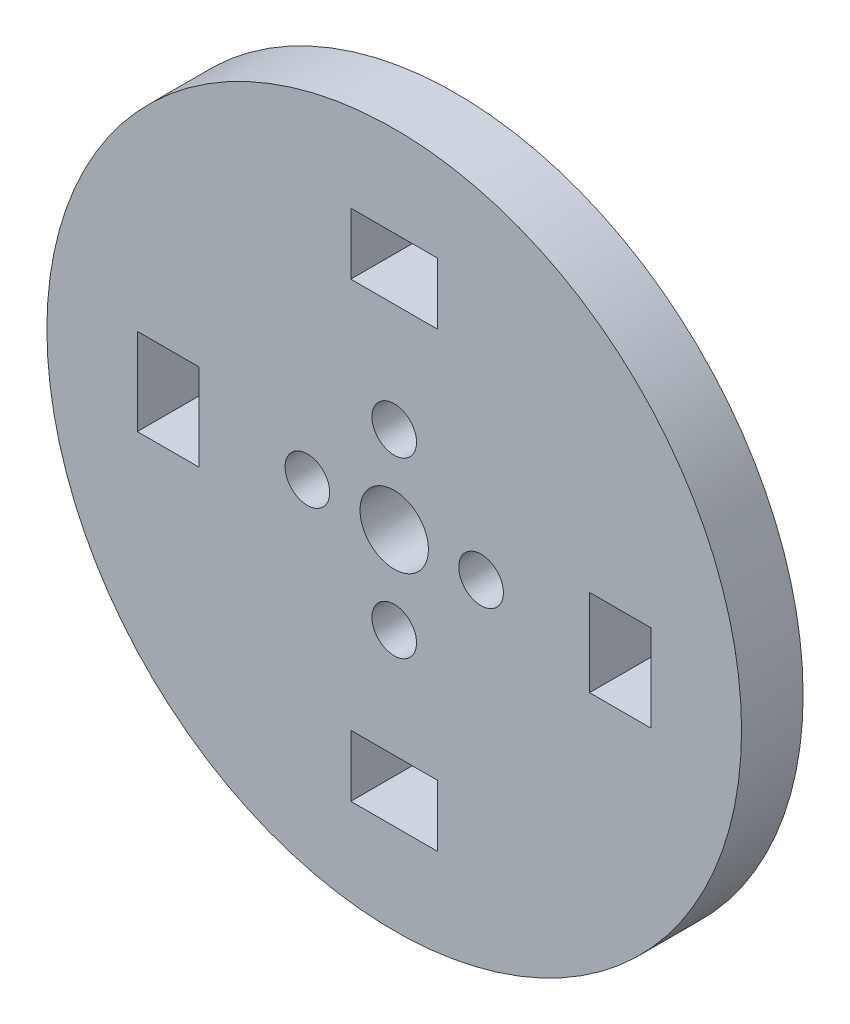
from build123d import *

# Parameters (mm, degrees)
SKETCH1_R                 = 25.4
SKETCH1_R_2               = 2.5
BOSS_EXTRUDE1_DEPTH       = 4.5
CUT_EXTRUDE1_DEPTH        = 37.201795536
F_4_CLEARANCE_HOLE1_D     = 3.2639
F_4_CLEARANCE_HOLE1_DEPTH = 25.4
F_4_CLEARANCE_HOLE1_TIP   = 0.980574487


with BuildPart() as part:
    # Sketch1 → Boss-Extrude1 (new body)
    with BuildSketch(Plane.XY):
        Circle(SKETCH1_R)
        Circle(SKETCH1_R_2, mode=Mode.SUBTRACT)
    extrude(amount=BOSS_EXTRUDE1_DEPTH)

    # Sketch2 → Cut-Extrude1 (cut, through all)
    with BuildSketch(Plane.XY.offset(4.5)):
        with BuildLine():
            Line((-14.283553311, 3.175), (-17.171437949, 3.175))
            ThreePointArc((-17.171437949, 3.175), (-17.4625, 0), (-17.171437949, -3.175))
            Line((-17.171437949, -3.175), (-14.283553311, -3.175))
            Line((-14.283553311, -3.175), (-14.283553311, 3.175))
        make_face()
        with BuildLine():
            Line((-17.171437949, 3.175), (-18.783553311, 3.175))
            Line((-18.783553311, 3.175), (-18.783553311, -3.175))
            Line((-18.783553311, -3.175), (-17.171437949, -3.175))
            ThreePointArc((-17.171437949, -3.175), (-17.4625, 0), (-17.171437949, 3.175))
        make_face()
        with BuildLine():
            Line((3.175, 18.783553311), (0, 18.783553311))
            Line((0, 18.783553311), (0, 17.4625))
            ThreePointArc((0, 17.4625), (1.594156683, 17.389582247), (3.175, 17.171437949))
            Line((3.175, 17.171437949), (3.175, 18.783553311))
        make_face()
        with BuildLine():
            Line((0, 17.4625), (0, 18.783553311))
            Line((0, 18.783553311), (-3.175, 18.783553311))
            Line((-3.175, 18.783553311), (-3.175, 17.171437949))
            ThreePointArc((-3.175, 17.171437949), (-1.594156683, 17.389582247), (0, 17.4625))
        make_face()
        with BuildLine():
            Line((0, 14.283553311), (0, 17.4625))
            ThreePointArc((0, 17.4625), (-1.594156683, 17.389582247), (-3.175, 17.171437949))
            Line((-3.175, 17.171437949), (-3.175, 14.283553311))
            Line((-3.175, 14.283553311), (0, 14.283553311))
        make_face()
        with BuildLine():
            ThreePointArc((3.175, 17.171437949), (1.594156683, 17.389582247), (0, 17.4625))
            Line((0, 17.4625), (0, 14.283553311))
            Line((0, 14.283553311), (3.175, 14.283553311))
            Line((3.175, 14.283553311), (3.175, 17.171437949))
        make_face()
        with BuildLine():
            ThreePointArc((17.4625, 0), (17.389582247, 1.594156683), (17.171437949, 3.175))
            Line((17.171437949, 3.175), (14.283553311, 3.175))
            Line((14.283553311, 3.175), (14.283553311, -3.175))
            Line((14.283553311, -3.175), (17.171437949, -3.175))
            ThreePointArc((17.171437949, -3.175), (17.389582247, -1.594156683), (17.4625, 0))
        make_face()
        with BuildLine():
            Line((18.783553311, -3.175), (18.783553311, 3.175))
            Line((18.783553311, 3.175), (17.171437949, 3.175))
            ThreePointArc((17.171437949, 3.175), (17.389582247, 1.594156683), (17.4625, 0))
            ThreePointArc((17.4625, 0), (17.389582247, -1.594156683), (17.171437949, -3.175))
            Line((17.171437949, -3.175), (18.783553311, -3.175))
        make_face()
        with BuildLine():
            Line((-3.175, -14.283553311), (-3.175, -17.171437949))
            ThreePointArc((-3.175, -17.171437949), (0, -17.4625), (3.175, -17.171437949))
            Line((3.175, -17.171437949), (3.175, -14.283553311))
            Line((3.175, -14.283553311), (-3.175, -14.283553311))
        make_face()
        with BuildLine():
            Line((-3.175, -17.171437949), (-3.175, -18.783553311))
            Line((-3.175, -18.783553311), (3.175, -18.783553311))
            Line((3.175, -18.783553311), (3.175, -17.171437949))
            ThreePointArc((3.175, -17.171437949), (0, -17.4625), (-3.175, -17.171437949))
        make_face()
    extrude(amount=-CUT_EXTRUDE1_DEPTH, mode=Mode.SUBTRACT)

    # 4 Clearance Hole1
    with Locations(Plane.XY.offset(4.5)):
        with Locations((0, 6.35), (6.35, 0), (0, -6.35), (-6.35, 0)):
            Hole(F_4_CLEARANCE_HOLE1_D / 2, depth=F_4_CLEARANCE_HOLE1_DEPTH)
            with Locations((0, 0, -(F_4_CLEARANCE_HOLE1_DEPTH + F_4_CLEARANCE_HOLE1_TIP / 2))):  # 118° drill point
                Cone(0, F_4_CLEARANCE_HOLE1_D / 2, F_4_CLEARANCE_HOLE1_TIP, mode=Mode.SUBTRACT)


solid = part.part
